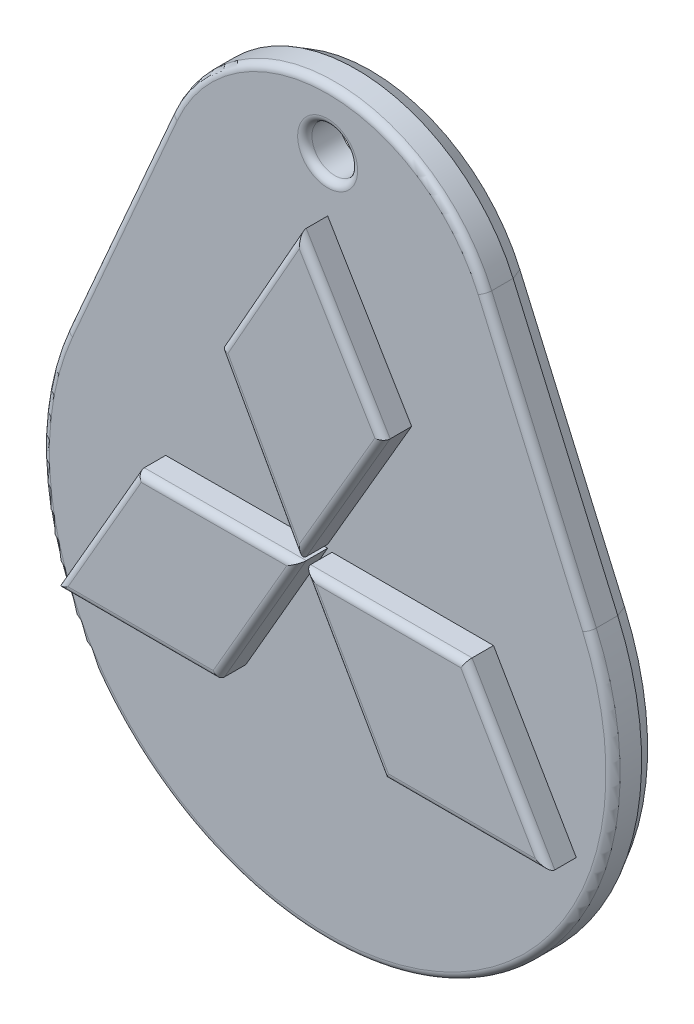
from build123d import *
from OCP.BRepFilletAPI import BRepFilletAPI_MakeChamfer

# Parameters (mm, degrees)
EXTRUDE1_DEPTH     = 3
EXTRUDE2_DEPTH     = 2
EXTRUDE3_DEPTH     = 2
EXTRUDE4_DEPTH     = 2
FILLET1_R          = 0.5
SKETCH6_R          = 1.6
CUT_EXTRUDE1_DEPTH = 38.854986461
FILLET2_R          = 0.5
CHAMFER1_SIZE      = 1
CHAMFER1_SIZE2     = 0.577350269


with BuildPart() as part:
    # Sketch1 → Extrude1 (new body)
    with BuildSketch(Plane.XY):
        with BuildLine():
            Line((10.998181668, 24.8), (18.33030278, 8))
            ThreePointArc((18.33030278, 8), (0, -20), (-18.33030278, 8))
            Line((-18.33030278, 8), (-10.998181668, 24.8))
            ThreePointArc((-10.998181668, 24.8), (0, 32), (10.998181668, 24.8))
        make_face()
    extrude(amount=-EXTRUDE1_DEPTH)

    # Sketch2 → Extrude2 (add)
    with BuildSketch(Plane.XY):
        Polygon((0, 4.160131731), (-5.554990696, 14.258372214), (0, 24.088042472), (5.886100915, 14.258372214), align=None)
    extrude(amount=EXTRUDE2_DEPTH)

    # Sketch3 → Extrude3 (add)
    with BuildSketch(Plane.XY):
        Polygon((0, 3.925797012), (-5.731661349, -6.006222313), (-17.056406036, -6.006222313), (-11.34902017, 3.883731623), align=None)
    extrude(amount=EXTRUDE3_DEPTH)

    # Sketch4 → Extrude4 (add)
    with BuildSketch(Plane.XY):
        Polygon((0.305835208, 3.831755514), (11.622162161, 3.831755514), (17.421387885, -6.136643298), (5.963998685, -6.136643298), align=None)
    extrude(amount=EXTRUDE4_DEPTH)

    # Fillet1
    fillet1_edges = [part.edges().sort_by_distance(p)[0] for p in [
        (2.943050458, 9.209251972, 2),
        (2.943050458, 19.173207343, 2),
        (-2.777495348, 19.173207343, 2),
        (-2.777495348, 9.209251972, 2),
        (-11.394033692, -6.006222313, 2),
        (-2.865830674, -1.040212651, 2),
        (-5.674510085, 3.904764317, 2),
        (-14.202713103, -1.061245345, 2),
        (3.134916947, -1.152443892, 2),
        (11.692693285, -6.136643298, 2),
        (14.521775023, -1.152443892, 2),
        (5.963998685, 3.831755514, 2),
    ]]
    fillet(fillet1_edges, radius=FILLET1_R)

    # Sketch6 → Cut-Extrude1 (cut, through all)
    with BuildSketch(Plane.XY):
        with Locations((0, 27.890083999)):
            Circle(SKETCH6_R)
    extrude(amount=-CUT_EXTRUDE1_DEPTH, mode=Mode.SUBTRACT)

    # Fillet2
    fillet2_edges = [part.edges().sort_by_distance(p)[0] for p in [
        (-14.664242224, 16.4, 0),
        (0, 32, 0),
        (14.664242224, 16.4, 0),
        (0, -20, 0),
        (-1.6, 27.890083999, 0),
    ]]
    fillet(fillet2_edges, radius=FILLET2_R)

    # Chamfer1: one chamfer whose edges measure the first distance from different faces: ONE call of the kernel's chamfer builder (chamfer() names one face for all edges)
    chamfer1_edges_1 = [part.edges().sort_by_distance(p)[0] for p in [
        (0, 32, -3),
    ]]
    chamfer1_side_1 = [part.faces().sort_by_distance(p)[0] for p in [
        (0, 32, -1.75),
    ]]
    chamfer1_edges_2 = [part.edges().sort_by_distance(p)[0] for p in [
        (-14.664242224, 16.4, -3),
    ]]
    chamfer1_side_2 = [part.faces().sort_by_distance(p)[0] for p in [
        (-14.664242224, 16.4, -1.75),
    ]]
    chamfer1_edges_3 = [part.edges().sort_by_distance(p)[0] for p in [
        (0, -20, -3),
        (-1.6, 27.890083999, -3),
    ]]
    chamfer1_side_3 = [part.faces().sort_by_distance(p)[0] for p in [
        (0, 4.274069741, -3),
    ]]
    chamfer1_edges_4 = [part.edges().sort_by_distance(p)[0] for p in [
        (14.664242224, 16.4, -3),
    ]]
    chamfer1_side_4 = [part.faces().sort_by_distance(p)[0] for p in [
        (14.664242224, 16.4, -1.75),
    ]]
    chamfer1 = BRepFilletAPI_MakeChamfer(part.part.solid().wrapped)
    for e in chamfer1_edges_1:
        chamfer1.Add(CHAMFER1_SIZE, CHAMFER1_SIZE2, e.wrapped, chamfer1_side_1[0].wrapped)  # the first distance lies on this face
    for e in chamfer1_edges_2:
        chamfer1.Add(CHAMFER1_SIZE, CHAMFER1_SIZE2, e.wrapped, chamfer1_side_2[0].wrapped)  # the first distance lies on this face
    for e in chamfer1_edges_3:
        chamfer1.Add(CHAMFER1_SIZE, CHAMFER1_SIZE2, e.wrapped, chamfer1_side_3[0].wrapped)  # the first distance lies on this face
    for e in chamfer1_edges_4:
        chamfer1.Add(CHAMFER1_SIZE, CHAMFER1_SIZE2, e.wrapped, chamfer1_side_4[0].wrapped)  # the first distance lies on this face
    add(Compound.cast(chamfer1.Shape()), mode=Mode.REPLACE)


solid = part.part
